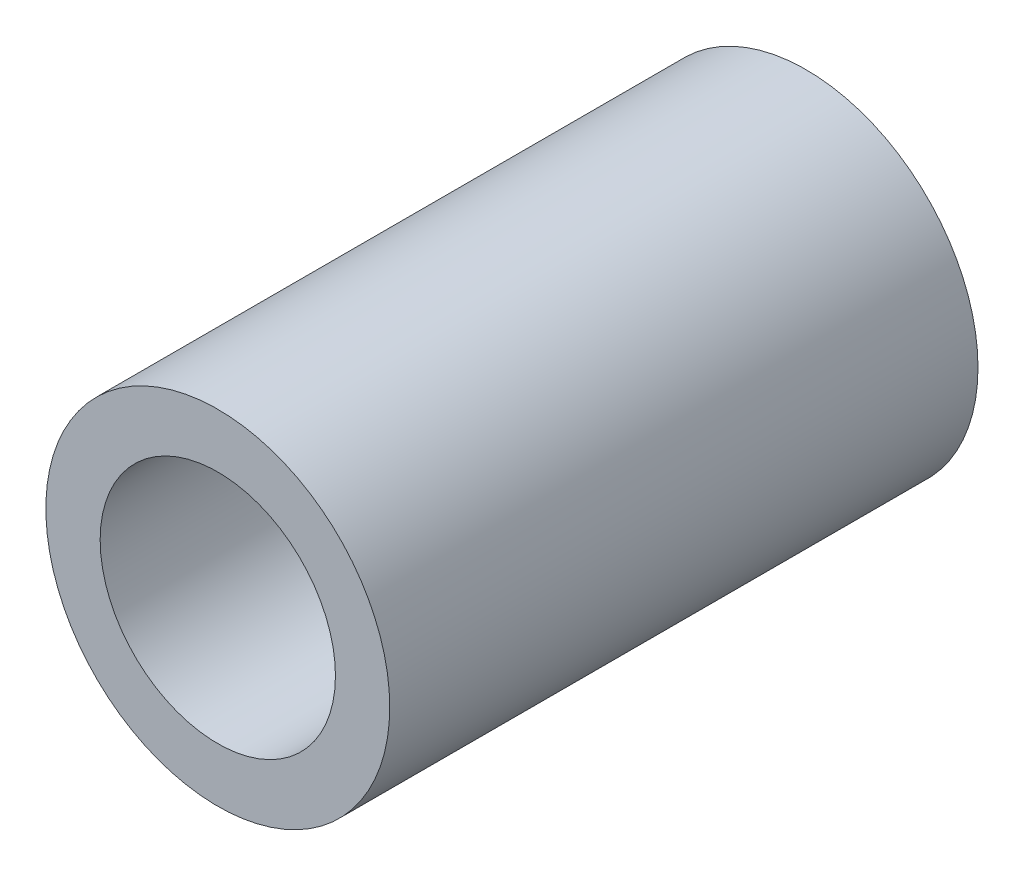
from build123d import *

# Parameters (mm, degrees)
SKETCH1_R                  = 19
SKETCH1_R_2                = 13
BOSS_EXTRUDE1_DEPTH        = 65
F_10_24_TAPPED_HOLE1_D     = 3.7973
F_10_24_TAPPED_HOLE1_DEPTH = 5
F_10_24_TAPPED_HOLE1_TIP   = 1.140824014


with BuildPart() as part:
    # Sketch1 → Boss-Extrude1 (new body)
    with BuildSketch(Plane.XY):
        Circle(SKETCH1_R)
        Circle(SKETCH1_R_2, mode=Mode.SUBTRACT)
    extrude(amount=BOSS_EXTRUDE1_DEPTH)

    # 10-24 Tapped Hole1
    with Locations(Plane(origin=(0, -19, 32.5), x_dir=(-1, 0, 0), z_dir=(0, -1, 0))):
        with Locations((0, 0)):
            Hole(F_10_24_TAPPED_HOLE1_D / 2, depth=F_10_24_TAPPED_HOLE1_DEPTH)
            with Locations((0, 0, -(F_10_24_TAPPED_HOLE1_DEPTH + F_10_24_TAPPED_HOLE1_TIP / 2))):  # 118° drill point
                Cone(0, F_10_24_TAPPED_HOLE1_D / 2, F_10_24_TAPPED_HOLE1_TIP, mode=Mode.SUBTRACT)


solid = part.part
